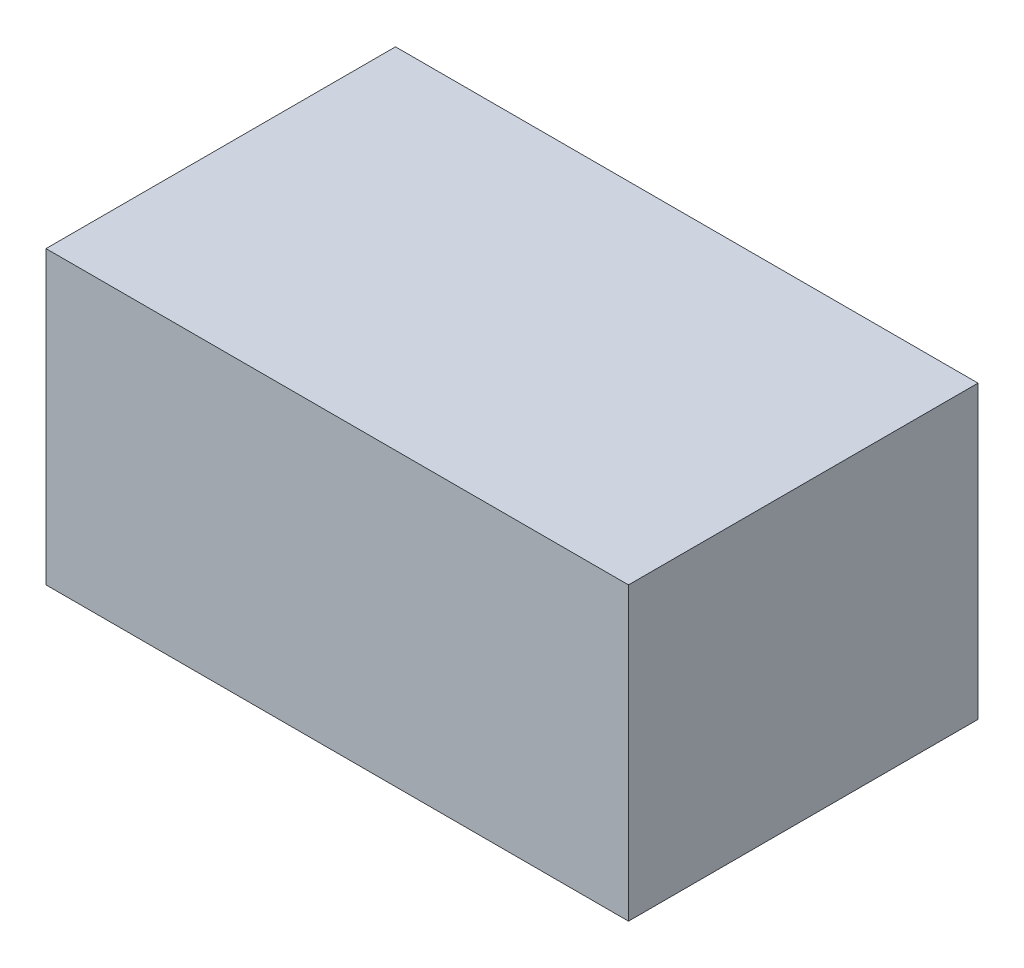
ISO-10303-21;
HEADER;
FILE_DESCRIPTION(('STEP AP214'),'2;1');
FILE_NAME('part.step','',(''),(''),'','','');
FILE_SCHEMA(('AUTOMOTIVE_DESIGN { 1 0 10303 214 1 1 1 1 }'));
ENDSEC;
DATA;
#1=APPLICATION_CONTEXT('core data for automotive mechanical design processes');
#2=APPLICATION_PROTOCOL_DEFINITION('international standard','automotive_design',2000,#1);
#3=PRODUCT_CONTEXT('',#1,'mechanical');
#4=PRODUCT('Part','Part','',(#3));
#5=PRODUCT_RELATED_PRODUCT_CATEGORY('part','',(#4));
#6=PRODUCT_DEFINITION_FORMATION('','',#4);
#7=PRODUCT_DEFINITION_CONTEXT('part definition',#1,'design');
#8=PRODUCT_DEFINITION('design','',#6,#7);
#9=PRODUCT_DEFINITION_SHAPE('','',#8);
#10=(LENGTH_UNIT() NAMED_UNIT(*) SI_UNIT(.MILLI.,.METRE.));
#11=(NAMED_UNIT(*) PLANE_ANGLE_UNIT() SI_UNIT($,.RADIAN.));
#12=(NAMED_UNIT(*) SI_UNIT($,.STERADIAN.) SOLID_ANGLE_UNIT());
#13=UNCERTAINTY_MEASURE_WITH_UNIT(LENGTH_MEASURE(1.E-05),#10,'distance_accuracy_value','');
#14=(GEOMETRIC_REPRESENTATION_CONTEXT(3) GLOBAL_UNCERTAINTY_ASSIGNED_CONTEXT((#13)) GLOBAL_UNIT_ASSIGNED_CONTEXT((#10,
#11,#12)) REPRESENTATION_CONTEXT('',''));
#15=CARTESIAN_POINT('',(0.,0.,0.));
#16=DIRECTION('',(0.,0.,1.));
#17=DIRECTION('',(1.,0.,0.));
#18=AXIS2_PLACEMENT_3D('',#15,#16,#17);
#19=CARTESIAN_POINT('',(0.,50.,0.));
#20=DIRECTION('',(1.,0.,0.));
#21=DIRECTION('',(0.,0.,-1.));
#22=AXIS2_PLACEMENT_3D('',#19,#20,#21);
#23=PLANE('',#22);
#24=DIRECTION('',(0.,0.,1.));
#25=VECTOR('',#24,1.);
#26=CARTESIAN_POINT('',(0.,0.,0.));
#27=LINE('',#26,#25);
#28=CARTESIAN_POINT('',(0.,0.,0.));
#29=VERTEX_POINT('',#28);
#30=CARTESIAN_POINT('',(0.,0.,60.));
#31=VERTEX_POINT('',#30);
#32=EDGE_CURVE('E108',#29,#31,#27,.T.);
#33=ORIENTED_EDGE('',*,*,#32,.T.);
#34=DIRECTION('',(0.,-1.,0.));
#35=VECTOR('',#34,1.);
#36=CARTESIAN_POINT('',(0.,50.,60.));
#37=LINE('',#36,#35);
#38=CARTESIAN_POINT('',(0.,50.,60.));
#39=VERTEX_POINT('',#38);
#40=EDGE_CURVE('E11',#39,#31,#37,.T.);
#41=ORIENTED_EDGE('',*,*,#40,.F.);
#42=DIRECTION('',(0.,0.,1.));
#43=VECTOR('',#42,1.);
#44=CARTESIAN_POINT('',(0.,50.,0.));
#45=LINE('',#44,#43);
#46=CARTESIAN_POINT('',(0.,50.,0.));
#47=VERTEX_POINT('',#46);
#48=EDGE_CURVE('E109',#47,#39,#45,.T.);
#49=ORIENTED_EDGE('',*,*,#48,.F.);
#50=DIRECTION('',(0.,-1.,0.));
#51=VECTOR('',#50,1.);
#52=CARTESIAN_POINT('',(0.,50.,0.));
#53=LINE('',#52,#51);
#54=EDGE_CURVE('E115',#47,#29,#53,.T.);
#55=ORIENTED_EDGE('',*,*,#54,.T.);
#56=EDGE_LOOP('',(#33,#41,#49,#55));
#57=FACE_BOUND('',#56,.T.);
#58=ADVANCED_FACE('F33',(#57),#23,.F.);
#59=CARTESIAN_POINT('',(0.,50.,60.));
#60=DIRECTION('',(0.,0.,-1.));
#61=DIRECTION('',(-1.,0.,0.));
#62=AXIS2_PLACEMENT_3D('',#59,#60,#61);
#63=PLANE('',#62);
#64=DIRECTION('',(1.,0.,0.));
#65=VECTOR('',#64,1.);
#66=CARTESIAN_POINT('',(0.,0.,60.));
#67=LINE('',#66,#65);
#68=CARTESIAN_POINT('',(100.,0.,60.));
#69=VERTEX_POINT('',#68);
#70=EDGE_CURVE('E118',#31,#69,#67,.T.);
#71=ORIENTED_EDGE('',*,*,#70,.T.);
#72=DIRECTION('',(0.,-1.,0.));
#73=VECTOR('',#72,1.);
#74=CARTESIAN_POINT('',(100.,50.,60.));
#75=LINE('',#74,#73);
#76=CARTESIAN_POINT('',(100.,50.,60.));
#77=VERTEX_POINT('',#76);
#78=EDGE_CURVE('E41',#77,#69,#75,.T.);
#79=ORIENTED_EDGE('',*,*,#78,.F.);
#80=DIRECTION('',(1.,0.,0.));
#81=VECTOR('',#80,1.);
#82=CARTESIAN_POINT('',(0.,50.,60.));
#83=LINE('',#82,#81);
#84=EDGE_CURVE('E80',#39,#77,#83,.T.);
#85=ORIENTED_EDGE('',*,*,#84,.F.);
#86=ORIENTED_EDGE('',*,*,#40,.T.);
#87=EDGE_LOOP('',(#71,#79,#85,#86));
#88=FACE_BOUND('',#87,.T.);
#89=ADVANCED_FACE('F141',(#88),#63,.F.);
#90=CARTESIAN_POINT('',(100.,50.,0.));
#91=DIRECTION('',(-1.,0.,0.));
#92=DIRECTION('',(0.,0.,1.));
#93=AXIS2_PLACEMENT_3D('',#90,#91,#92);
#94=PLANE('',#93);
#95=DIRECTION('',(0.,0.,-1.));
#96=VECTOR('',#95,1.);
#97=CARTESIAN_POINT('',(100.,0.,0.));
#98=LINE('',#97,#96);
#99=CARTESIAN_POINT('',(100.,0.,0.));
#100=VERTEX_POINT('',#99);
#101=EDGE_CURVE('E67',#69,#100,#98,.T.);
#102=ORIENTED_EDGE('',*,*,#101,.T.);
#103=DIRECTION('',(0.,-1.,0.));
#104=VECTOR('',#103,1.);
#105=CARTESIAN_POINT('',(100.,50.,0.));
#106=LINE('',#105,#104);
#107=CARTESIAN_POINT('',(100.,50.,0.));
#108=VERTEX_POINT('',#107);
#109=EDGE_CURVE('E123',#108,#100,#106,.T.);
#110=ORIENTED_EDGE('',*,*,#109,.F.);
#111=DIRECTION('',(0.,0.,-1.));
#112=VECTOR('',#111,1.);
#113=CARTESIAN_POINT('',(100.,50.,0.));
#114=LINE('',#113,#112);
#115=EDGE_CURVE('E112',#77,#108,#114,.T.);
#116=ORIENTED_EDGE('',*,*,#115,.F.);
#117=ORIENTED_EDGE('',*,*,#78,.T.);
#118=EDGE_LOOP('',(#102,#110,#116,#117));
#119=FACE_BOUND('',#118,.T.);
#120=ADVANCED_FACE('F125',(#119),#94,.F.);
#121=CARTESIAN_POINT('',(0.,50.,0.));
#122=DIRECTION('',(0.,0.,1.));
#123=DIRECTION('',(1.,0.,0.));
#124=AXIS2_PLACEMENT_3D('',#121,#122,#123);
#125=PLANE('',#124);
#126=DIRECTION('',(-1.,0.,0.));
#127=VECTOR('',#126,1.);
#128=CARTESIAN_POINT('',(0.,0.,0.));
#129=LINE('',#128,#127);
#130=EDGE_CURVE('E73',#100,#29,#129,.T.);
#131=ORIENTED_EDGE('',*,*,#130,.T.);
#132=ORIENTED_EDGE('',*,*,#54,.F.);
#133=DIRECTION('',(-1.,0.,0.));
#134=VECTOR('',#133,1.);
#135=CARTESIAN_POINT('',(0.,50.,0.));
#136=LINE('',#135,#134);
#137=EDGE_CURVE('E49',#108,#47,#136,.T.);
#138=ORIENTED_EDGE('',*,*,#137,.F.);
#139=ORIENTED_EDGE('',*,*,#109,.T.);
#140=EDGE_LOOP('',(#131,#132,#138,#139));
#141=FACE_BOUND('',#140,.T.);
#142=ADVANCED_FACE('F132',(#141),#125,.F.);
#143=CARTESIAN_POINT('',(0.,50.,60.));
#144=DIRECTION('',(0.,1.,0.));
#145=DIRECTION('',(0.,0.,1.));
#146=AXIS2_PLACEMENT_3D('',#143,#144,#145);
#147=PLANE('',#146);
#148=ORIENTED_EDGE('',*,*,#48,.T.);
#149=ORIENTED_EDGE('',*,*,#84,.T.);
#150=ORIENTED_EDGE('',*,*,#115,.T.);
#151=ORIENTED_EDGE('',*,*,#137,.T.);
#152=EDGE_LOOP('',(#148,#149,#150,#151));
#153=FACE_BOUND('',#152,.T.);
#154=ADVANCED_FACE('F134',(#153),#147,.T.);
#155=CARTESIAN_POINT('',(0.,0.,60.));
#156=DIRECTION('',(0.,1.,0.));
#157=DIRECTION('',(0.,0.,1.));
#158=AXIS2_PLACEMENT_3D('',#155,#156,#157);
#159=PLANE('',#158);
#160=CARTESIAN_POINT('',(75.,0.,30.));
#161=DIRECTION('',(0.,-1.,0.));
#162=DIRECTION('',(0.,0.,-1.));
#163=AXIS2_PLACEMENT_3D('',#160,#161,#162);
#164=CIRCLE('',#163,5.09999999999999);
#165=CARTESIAN_POINT('',(75.,0.,24.9));
#166=VERTEX_POINT('',#165);
#167=EDGE_CURVE('E98',#166,#166,#164,.T.);
#168=ORIENTED_EDGE('',*,*,#167,.F.);
#169=EDGE_LOOP('',(#168));
#170=FACE_BOUND('',#169,.T.);
#171=CARTESIAN_POINT('',(25.,0.,30.));
#172=DIRECTION('',(0.,-1.,0.));
#173=DIRECTION('',(0.,0.,-1.));
#174=AXIS2_PLACEMENT_3D('',#171,#172,#173);
#175=CIRCLE('',#174,5.09999999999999);
#176=CARTESIAN_POINT('',(25.,0.,24.9));
#177=VERTEX_POINT('',#176);
#178=EDGE_CURVE('E97',#177,#177,#175,.T.);
#179=ORIENTED_EDGE('',*,*,#178,.F.);
#180=EDGE_LOOP('',(#179));
#181=FACE_BOUND('',#180,.T.);
#182=ORIENTED_EDGE('',*,*,#32,.F.);
#183=ORIENTED_EDGE('',*,*,#130,.F.);
#184=ORIENTED_EDGE('',*,*,#101,.F.);
#185=ORIENTED_EDGE('',*,*,#70,.F.);
#186=EDGE_LOOP('',(#182,#183,#184,#185));
#187=FACE_BOUND('',#186,.T.);
#188=ADVANCED_FACE('F128',(#170,#181,#187),#159,.F.);
#189=CARTESIAN_POINT('',(25.,32.75,30.));
#190=DIRECTION('',(0.,-1.,0.));
#191=DIRECTION('',(0.,0.,-1.));
#192=AXIS2_PLACEMENT_3D('',#189,#190,#191);
#193=CONICAL_SURFACE('',#192,5.09999999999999,1.02974425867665);
#194=CARTESIAN_POINT('',(25.,35.8143891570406,30.));
#195=VERTEX_POINT('',#194);
#196=VERTEX_LOOP('',#195);
#197=FACE_BOUND('',#196,.T.);
#198=CARTESIAN_POINT('',(25.,32.75,30.));
#199=DIRECTION('',(0.,-1.,0.));
#200=DIRECTION('',(0.,0.,-1.));
#201=AXIS2_PLACEMENT_3D('',#198,#199,#200);
#202=CIRCLE('',#201,5.09999999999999);
#203=CARTESIAN_POINT('',(25.,32.75,24.9));
#204=VERTEX_POINT('',#203);
#205=EDGE_CURVE('E101',#204,#204,#202,.T.);
#206=ORIENTED_EDGE('',*,*,#205,.T.);
#207=EDGE_LOOP('',(#206));
#208=FACE_BOUND('',#207,.T.);
#209=ADVANCED_FACE('F173',(#197,#208),#193,.F.);
#210=CARTESIAN_POINT('',(25.,0.,30.));
#211=DIRECTION('',(0.,-1.,0.));
#212=DIRECTION('',(0.,0.,-1.));
#213=AXIS2_PLACEMENT_3D('',#210,#211,#212);
#214=CYLINDRICAL_SURFACE('',#213,5.09999999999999);
#215=ORIENTED_EDGE('',*,*,#205,.F.);
#216=EDGE_LOOP('',(#215));
#217=FACE_BOUND('',#216,.T.);
#218=ORIENTED_EDGE('',*,*,#178,.T.);
#219=EDGE_LOOP('',(#218));
#220=FACE_BOUND('',#219,.T.);
#221=ADVANCED_FACE('F91',(#217,#220),#214,.F.);
#222=CARTESIAN_POINT('',(75.,32.75,30.));
#223=DIRECTION('',(0.,-1.,0.));
#224=DIRECTION('',(0.,0.,-1.));
#225=AXIS2_PLACEMENT_3D('',#222,#223,#224);
#226=CONICAL_SURFACE('',#225,5.09999999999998,1.02974425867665);
#227=CARTESIAN_POINT('',(75.,35.8143891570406,30.));
#228=VERTEX_POINT('',#227);
#229=VERTEX_LOOP('',#228);
#230=FACE_BOUND('',#229,.T.);
#231=CARTESIAN_POINT('',(75.,32.75,30.));
#232=DIRECTION('',(0.,-1.,0.));
#233=DIRECTION('',(0.,0.,-1.));
#234=AXIS2_PLACEMENT_3D('',#231,#232,#233);
#235=CIRCLE('',#234,5.09999999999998);
#236=CARTESIAN_POINT('',(75.,32.75,24.9));
#237=VERTEX_POINT('',#236);
#238=EDGE_CURVE('E95',#237,#237,#235,.T.);
#239=ORIENTED_EDGE('',*,*,#238,.T.);
#240=EDGE_LOOP('',(#239));
#241=FACE_BOUND('',#240,.T.);
#242=ADVANCED_FACE('F87',(#230,#241),#226,.F.);
#243=CARTESIAN_POINT('',(75.,0.,30.));
#244=DIRECTION('',(0.,-1.,0.));
#245=DIRECTION('',(0.,0.,-1.));
#246=AXIS2_PLACEMENT_3D('',#243,#244,#245);
#247=CYLINDRICAL_SURFACE('',#246,5.09999999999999);
#248=ORIENTED_EDGE('',*,*,#238,.F.);
#249=EDGE_LOOP('',(#248));
#250=FACE_BOUND('',#249,.T.);
#251=ORIENTED_EDGE('',*,*,#167,.T.);
#252=EDGE_LOOP('',(#251));
#253=FACE_BOUND('',#252,.T.);
#254=ADVANCED_FACE('F90',(#250,#253),#247,.F.);
#255=CLOSED_SHELL('',(#58,#89,#120,#142,#154,#188,#209,#221,#242,#254));
#256=MANIFOLD_SOLID_BREP('B2',#255);
#257=ADVANCED_BREP_SHAPE_REPRESENTATION('',(#18,#256),#14);
#258=SHAPE_DEFINITION_REPRESENTATION(#9,#257);
ENDSEC;
END-ISO-10303-21;
